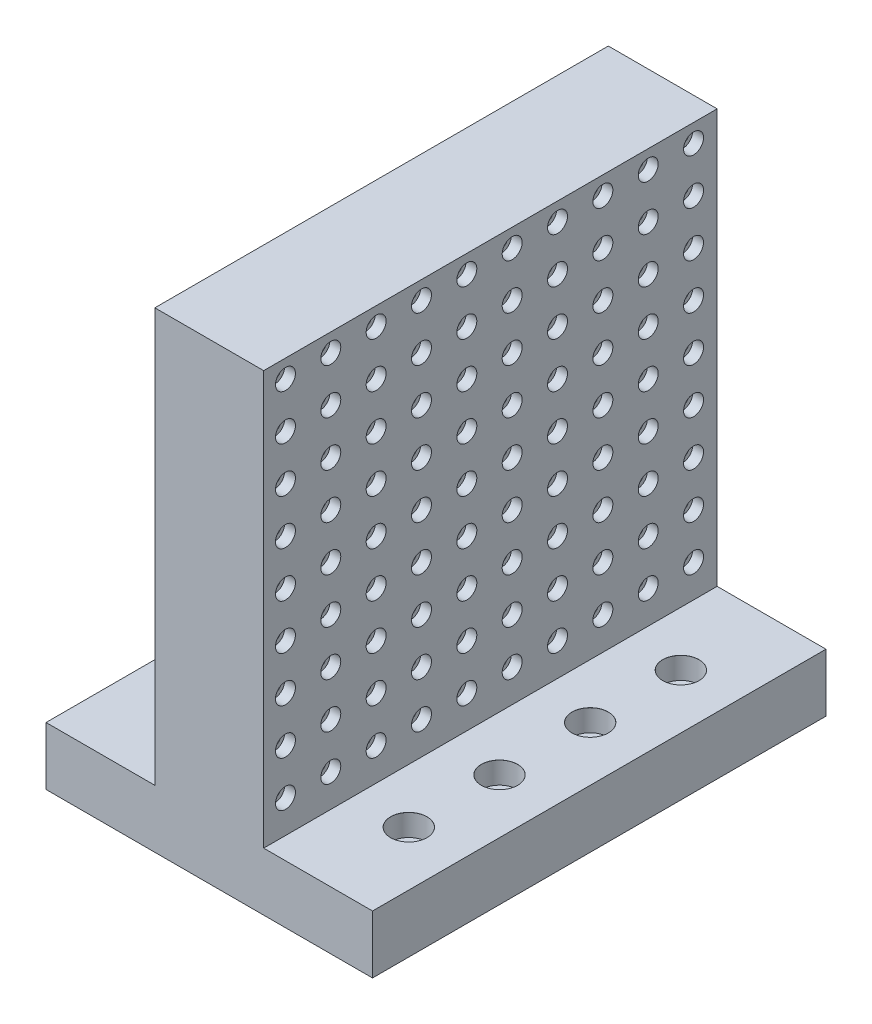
from build123d import *

# Parameters (mm, degrees)
BOSS_EXTRU_1_DEPTH                                 = 250
CHAMBRAGE_POUR_VIS_T_TE_HEXAGONALE_M61_D           = 6.6
CHAMBRAGE_POUR_VIS_T_TE_HEXAGONALE_M61_CBORE_D     = 11
CHAMBRAGE_POUR_VIS_T_TE_HEXAGONALE_M61_CBORE_DEPTH = 6
ENL_V_START                                        = -6
ESQUISSE8_R                                        = 5.5
ENL_V_MAT_EXTRU_1_DEPTH                            = 6
R_P_TITION_LIN_AIRE1_COUNT                         = 10
R_P_TITION_LIN_AIRE1_PITCH                         = 25
R_P_TITION_LIN_AIRE1_COUNT_DIR2                    = 9
R_P_TITION_LIN_AIRE1_PITCH_DIR2                    = 25
CHAMBRAGE_POUR_VIS_T_TE_HEXAGONALE_2_COUNT         = 2
CHAMBRAGE_POUR_VIS_T_TE_HEXAGONALE_2_PITCH         = 50
CHAMBRAGE_POUR_VIS_T_TE_HEXAGONALE_3_COUNT         = 2
CHAMBRAGE_POUR_VIS_T_TE_HEXAGONALE_3_PITCH         = 100
CHAMBRAGE_POUR_VIS_T_TE_HEXAGONALE_4_COUNT         = 2
CHAMBRAGE_POUR_VIS_T_TE_HEXAGONALE_4_PITCH         = 150
CHAMBRAGE_POUR_VIS_T_TE_HEXAGONALE_5_COUNT         = 2
CHAMBRAGE_POUR_VIS_T_TE_HEXAGONALE_5_PITCH         = 192.093727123
CHAMBRAGE_POUR_VIS_T_TE_HEXAGONALE_6_COUNT         = 2
CHAMBRAGE_POUR_VIS_T_TE_HEXAGONALE_6_PITCH         = 156.204993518
CHAMBRAGE_POUR_VIS_T_TE_HEXAGONALE_7_COUNT         = 2
CHAMBRAGE_POUR_VIS_T_TE_HEXAGONALE_7_PITCH         = 130
CHAMBRAGE_POUR_VIS_T_TE_HEXAGONALE_8_COUNT         = 2
CHAMBRAGE_POUR_VIS_T_TE_HEXAGONALE_8_PITCH         = 120


with BuildPart() as part:
    # Esquisse1 → Boss.-Extru.1 (new body)
    with BuildSketch(Plane.XY):
        Polygon((-17.338840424, 0), (162.661159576, 0), (162.661159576, 32), (102.661159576, 32), (102.661159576, 260), (42.661159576, 260), (42.661159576, 32), (-17.338840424, 32), align=None)
    extrude(amount=-BOSS_EXTRU_1_DEPTH)

    # Chambrage pour vis _ t_te hexagonale M61 (through all)
    with Locations(Plane(origin=(102.661159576, 0, 0), x_dir=(0, 0, -1), z_dir=(1, 0, 0))):
        with Locations((12, 250)):
            chambrage_pour_vis_t_te_hexagonale_m61 = CounterBoreHole(CHAMBRAGE_POUR_VIS_T_TE_HEXAGONALE_M61_D / 2, CHAMBRAGE_POUR_VIS_T_TE_HEXAGONALE_M61_CBORE_D / 2, CHAMBRAGE_POUR_VIS_T_TE_HEXAGONALE_M61_CBORE_DEPTH)

    # Esquisse8 → Enl_v. mat.-Extru.1 (cut)
    with BuildSketch(Plane.ZY.offset(-42.661159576).offset(ENL_V_START)):
        with Locations(Location((-12, 250, 0), (0, 0, 180))):
            Circle(ESQUISSE8_R)
    enl_v_mat_extru_1 = extrude(amount=ENL_V_MAT_EXTRU_1_DEPTH, mode=Mode.SUBTRACT)

    # R_p_tition lin_aire1: Chambrage pour vis _ t_te hexagonale M61, Enl_v. mat.-Extru.1 10 × 9
    with Locations(*[(0, -j * R_P_TITION_LIN_AIRE1_PITCH_DIR2, -i * R_P_TITION_LIN_AIRE1_PITCH) for i in range(R_P_TITION_LIN_AIRE1_COUNT) for j in range(R_P_TITION_LIN_AIRE1_COUNT_DIR2) if (i, j) != (0, 0)]):
        add(chambrage_pour_vis_t_te_hexagonale_m61, mode=Mode.SUBTRACT)
        add(enl_v_mat_extru_1, mode=Mode.SUBTRACT)

    # Esquisse9 → Chambrage pour vis _ t_te hexagonale M12 (revolve, cut)
    with BuildSketch(Plane(origin=(132.661159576, 32, -50), x_dir=(0, 0, 1), z_dir=(1, 0, 0))):
        Polygon((0, 0), (0, 32), (7.275, 32), (6.75, 31.475), (6.75, 12), (10, 12), (10, 0.025), (10.025, 0), align=None)
    chambrage_pour_vis_t_te_hexagonale_m12 = revolve(axis=Axis((132.661159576, 38.35, -50), (0, -1, 0)), mode=Mode.SUBTRACT)

    # Chambrage pour vis _ t_te hexagonale 2: Chambrage pour vis _ t_te hexagonale M12 ×2
    with Locations(*[(0, 0, -i * CHAMBRAGE_POUR_VIS_T_TE_HEXAGONALE_2_PITCH) for i in range(1, CHAMBRAGE_POUR_VIS_T_TE_HEXAGONALE_2_COUNT)]):
        add(chambrage_pour_vis_t_te_hexagonale_m12, mode=Mode.SUBTRACT)

    # Chambrage pour vis _ t_te hexagonale 3: Chambrage pour vis _ t_te hexagonale M12 ×2
    with Locations(*[(0, 0, -i * CHAMBRAGE_POUR_VIS_T_TE_HEXAGONALE_3_PITCH) for i in range(1, CHAMBRAGE_POUR_VIS_T_TE_HEXAGONALE_3_COUNT)]):
        add(chambrage_pour_vis_t_te_hexagonale_m12, mode=Mode.SUBTRACT)

    # Chambrage pour vis _ t_te hexagonale 4: Chambrage pour vis _ t_te hexagonale M12 ×2
    with Locations(*[(0, 0, -i * CHAMBRAGE_POUR_VIS_T_TE_HEXAGONALE_4_PITCH) for i in range(1, CHAMBRAGE_POUR_VIS_T_TE_HEXAGONALE_4_COUNT)]):
        add(chambrage_pour_vis_t_te_hexagonale_m12, mode=Mode.SUBTRACT)

    # Chambrage pour vis _ t_te hexagonale 5: Chambrage pour vis _ t_te hexagonale M12 ×2
    with Locations(*[Vector(-0.6246950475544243, 0, -0.7808688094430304) * (i * CHAMBRAGE_POUR_VIS_T_TE_HEXAGONALE_5_PITCH) for i in range(1, CHAMBRAGE_POUR_VIS_T_TE_HEXAGONALE_5_COUNT)]):
        add(chambrage_pour_vis_t_te_hexagonale_m12, mode=Mode.SUBTRACT)

    # Chambrage pour vis _ t_te hexagonale 6: Chambrage pour vis _ t_te hexagonale M12 ×2
    with Locations(*[Vector(-0.7682212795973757, 0, -0.6401843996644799) * (i * CHAMBRAGE_POUR_VIS_T_TE_HEXAGONALE_6_PITCH) for i in range(1, CHAMBRAGE_POUR_VIS_T_TE_HEXAGONALE_6_COUNT)]):
        add(chambrage_pour_vis_t_te_hexagonale_m12, mode=Mode.SUBTRACT)

    # Chambrage pour vis _ t_te hexagonale 7: Chambrage pour vis _ t_te hexagonale M12 ×2
    with Locations(*[Vector(-0.9230769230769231, 0, -0.38461538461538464) * (i * CHAMBRAGE_POUR_VIS_T_TE_HEXAGONALE_7_PITCH) for i in range(1, CHAMBRAGE_POUR_VIS_T_TE_HEXAGONALE_7_COUNT)]):
        add(chambrage_pour_vis_t_te_hexagonale_m12, mode=Mode.SUBTRACT)

    # Chambrage pour vis _ t_te hexagonale 8: Chambrage pour vis _ t_te hexagonale M12 ×2
    with Locations(*[(-i * CHAMBRAGE_POUR_VIS_T_TE_HEXAGONALE_8_PITCH, 0, 0) for i in range(1, CHAMBRAGE_POUR_VIS_T_TE_HEXAGONALE_8_COUNT)]):
        add(chambrage_pour_vis_t_te_hexagonale_m12, mode=Mode.SUBTRACT)


solid = part.part
